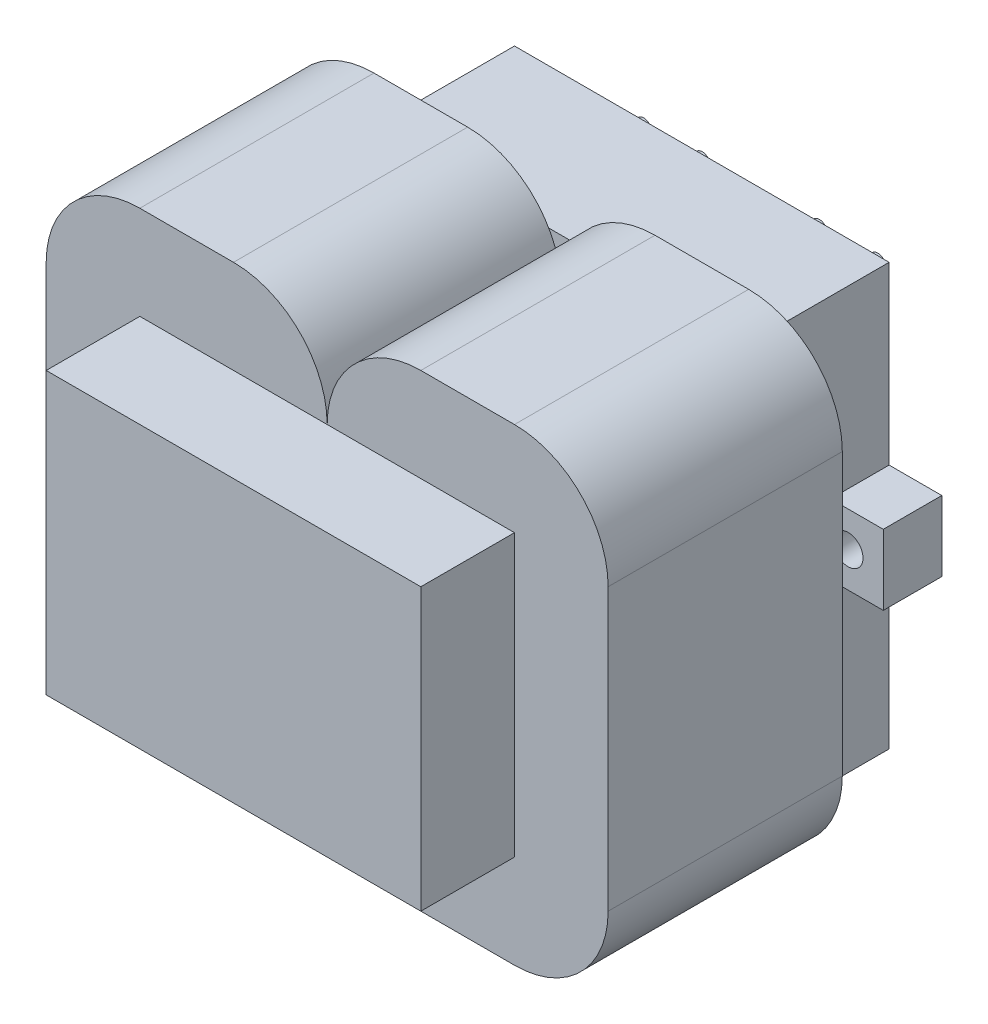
ISO-10303-21;
HEADER;
FILE_DESCRIPTION(('STEP AP214'),'2;1');
FILE_NAME('part.step','',(''),(''),'','','');
FILE_SCHEMA(('AUTOMOTIVE_DESIGN { 1 0 10303 214 1 1 1 1 }'));
ENDSEC;
DATA;
#1=APPLICATION_CONTEXT('core data for automotive mechanical design processes');
#2=APPLICATION_PROTOCOL_DEFINITION('international standard','automotive_design',2000,#1);
#3=PRODUCT_CONTEXT('',#1,'mechanical');
#4=PRODUCT('Part','Part','',(#3));
#5=PRODUCT_RELATED_PRODUCT_CATEGORY('part','',(#4));
#6=PRODUCT_DEFINITION_FORMATION('','',#4);
#7=PRODUCT_DEFINITION_CONTEXT('part definition',#1,'design');
#8=PRODUCT_DEFINITION('design','',#6,#7);
#9=PRODUCT_DEFINITION_SHAPE('','',#8);
#10=(LENGTH_UNIT() NAMED_UNIT(*) SI_UNIT(.MILLI.,.METRE.));
#11=(NAMED_UNIT(*) PLANE_ANGLE_UNIT() SI_UNIT($,.RADIAN.));
#12=(NAMED_UNIT(*) SI_UNIT($,.STERADIAN.) SOLID_ANGLE_UNIT());
#13=UNCERTAINTY_MEASURE_WITH_UNIT(LENGTH_MEASURE(1.E-05),#10,'distance_accuracy_value','');
#14=(GEOMETRIC_REPRESENTATION_CONTEXT(3) GLOBAL_UNCERTAINTY_ASSIGNED_CONTEXT((#13)) GLOBAL_UNIT_ASSIGNED_CONTEXT((#10,
#11,#12)) REPRESENTATION_CONTEXT('',''));
#15=CARTESIAN_POINT('',(0.,0.,0.));
#16=DIRECTION('',(0.,0.,1.));
#17=DIRECTION('',(1.,0.,0.));
#18=AXIS2_PLACEMENT_3D('',#15,#16,#17);
#19=CARTESIAN_POINT('',(-8.,-12.,32.));
#20=DIRECTION('',(0.,0.,-1.));
#21=DIRECTION('',(-1.,0.,0.));
#22=AXIS2_PLACEMENT_3D('',#19,#20,#21);
#23=CYLINDRICAL_SURFACE('',#22,8.);
#24=CARTESIAN_POINT('',(-8.,-12.,12.));
#25=DIRECTION('',(0.,0.,1.));
#26=DIRECTION('',(1.,0.,0.));
#27=AXIS2_PLACEMENT_3D('',#24,#25,#26);
#28=CIRCLE('',#27,8.);
#29=CARTESIAN_POINT('',(-8.,-20.,12.));
#30=VERTEX_POINT('',#29);
#31=CARTESIAN_POINT('',(0.,-12.,12.));
#32=VERTEX_POINT('',#31);
#33=EDGE_CURVE('E172',#30,#32,#28,.T.);
#34=ORIENTED_EDGE('',*,*,#33,.T.);
#35=DIRECTION('',(0.,0.,-1.));
#36=VECTOR('',#35,1.);
#37=CARTESIAN_POINT('',(0.,-12.,32.));
#38=LINE('',#37,#36);
#39=CARTESIAN_POINT('',(0.,-12.,32.));
#40=VERTEX_POINT('',#39);
#41=EDGE_CURVE('E12',#40,#32,#38,.T.);
#42=ORIENTED_EDGE('',*,*,#41,.F.);
#43=CARTESIAN_POINT('',(-8.,-12.,32.));
#44=DIRECTION('',(0.,0.,1.));
#45=DIRECTION('',(1.,0.,0.));
#46=AXIS2_PLACEMENT_3D('',#43,#44,#45);
#47=CIRCLE('',#46,8.);
#48=CARTESIAN_POINT('',(-8.,-20.,32.));
#49=VERTEX_POINT('',#48);
#50=EDGE_CURVE('E198',#49,#40,#47,.T.);
#51=ORIENTED_EDGE('',*,*,#50,.F.);
#52=DIRECTION('',(0.,0.,-1.));
#53=VECTOR('',#52,1.);
#54=CARTESIAN_POINT('',(-8.,-20.,32.));
#55=LINE('',#54,#53);
#56=EDGE_CURVE('E168',#49,#30,#55,.T.);
#57=ORIENTED_EDGE('',*,*,#56,.T.);
#58=EDGE_LOOP('',(#34,#42,#51,#57));
#59=FACE_BOUND('',#58,.T.);
#60=ADVANCED_FACE('F40',(#59),#23,.T.);
#61=CARTESIAN_POINT('',(8.,-12.,32.));
#62=DIRECTION('',(0.,0.,-1.));
#63=DIRECTION('',(-1.,0.,0.));
#64=AXIS2_PLACEMENT_3D('',#61,#62,#63);
#65=CYLINDRICAL_SURFACE('',#64,8.);
#66=CARTESIAN_POINT('',(8.,-12.,12.));
#67=DIRECTION('',(0.,0.,1.));
#68=DIRECTION('',(1.,0.,0.));
#69=AXIS2_PLACEMENT_3D('',#66,#67,#68);
#70=CIRCLE('',#69,8.);
#71=CARTESIAN_POINT('',(8.,-20.,12.));
#72=VERTEX_POINT('',#71);
#73=EDGE_CURVE('E175',#32,#72,#70,.T.);
#74=ORIENTED_EDGE('',*,*,#73,.T.);
#75=DIRECTION('',(0.,0.,-1.));
#76=VECTOR('',#75,1.);
#77=CARTESIAN_POINT('',(8.,-20.,32.));
#78=LINE('',#77,#76);
#79=CARTESIAN_POINT('',(8.,-20.,32.));
#80=VERTEX_POINT('',#79);
#81=EDGE_CURVE('E48',#80,#72,#78,.T.);
#82=ORIENTED_EDGE('',*,*,#81,.F.);
#83=CARTESIAN_POINT('',(8.,-12.,32.));
#84=DIRECTION('',(0.,0.,1.));
#85=DIRECTION('',(1.,0.,0.));
#86=AXIS2_PLACEMENT_3D('',#83,#84,#85);
#87=CIRCLE('',#86,8.);
#88=EDGE_CURVE('E117',#40,#80,#87,.T.);
#89=ORIENTED_EDGE('',*,*,#88,.F.);
#90=ORIENTED_EDGE('',*,*,#41,.T.);
#91=EDGE_LOOP('',(#74,#82,#89,#90));
#92=FACE_BOUND('',#91,.T.);
#93=ADVANCED_FACE('F286',(#92),#65,.T.);
#94=CARTESIAN_POINT('',(8.,-20.,32.));
#95=DIRECTION('',(0.,1.,0.));
#96=DIRECTION('',(0.,0.,1.));
#97=AXIS2_PLACEMENT_3D('',#94,#95,#96);
#98=PLANE('',#97);
#99=DIRECTION('',(1.,0.,0.));
#100=VECTOR('',#99,1.);
#101=CARTESIAN_POINT('',(8.,-20.,12.));
#102=LINE('',#101,#100);
#103=CARTESIAN_POINT('',(16.,-20.,12.));
#104=VERTEX_POINT('',#103);
#105=EDGE_CURVE('E177',#72,#104,#102,.T.);
#106=ORIENTED_EDGE('',*,*,#105,.T.);
#107=DIRECTION('',(0.,0.,-1.));
#108=VECTOR('',#107,1.);
#109=CARTESIAN_POINT('',(16.,-20.,32.));
#110=LINE('',#109,#108);
#111=CARTESIAN_POINT('',(16.,-20.,32.));
#112=VERTEX_POINT('',#111);
#113=EDGE_CURVE('E223',#112,#104,#110,.T.);
#114=ORIENTED_EDGE('',*,*,#113,.F.);
#115=DIRECTION('',(1.,0.,0.));
#116=VECTOR('',#115,1.);
#117=CARTESIAN_POINT('',(8.,-20.,32.));
#118=LINE('',#117,#116);
#119=EDGE_CURVE('E231',#80,#112,#118,.T.);
#120=ORIENTED_EDGE('',*,*,#119,.F.);
#121=ORIENTED_EDGE('',*,*,#81,.T.);
#122=EDGE_LOOP('',(#106,#114,#120,#121));
#123=FACE_BOUND('',#122,.T.);
#124=ADVANCED_FACE('F229',(#123),#98,.F.);
#125=CARTESIAN_POINT('',(16.,-12.,32.));
#126=DIRECTION('',(0.,0.,-1.));
#127=DIRECTION('',(-1.,0.,0.));
#128=AXIS2_PLACEMENT_3D('',#125,#126,#127);
#129=CYLINDRICAL_SURFACE('',#128,8.);
#130=CARTESIAN_POINT('',(16.,-12.,12.));
#131=DIRECTION('',(0.,0.,1.));
#132=DIRECTION('',(1.,0.,0.));
#133=AXIS2_PLACEMENT_3D('',#130,#131,#132);
#134=CIRCLE('',#133,8.);
#135=CARTESIAN_POINT('',(24.,-12.,12.));
#136=VERTEX_POINT('',#135);
#137=EDGE_CURVE('E179',#104,#136,#134,.T.);
#138=ORIENTED_EDGE('',*,*,#137,.T.);
#139=DIRECTION('',(0.,0.,-1.));
#140=VECTOR('',#139,1.);
#141=CARTESIAN_POINT('',(24.,-12.,32.));
#142=LINE('',#141,#140);
#143=CARTESIAN_POINT('',(24.,-12.,32.));
#144=VERTEX_POINT('',#143);
#145=EDGE_CURVE('E220',#144,#136,#142,.T.);
#146=ORIENTED_EDGE('',*,*,#145,.F.);
#147=CARTESIAN_POINT('',(16.,-12.,32.));
#148=DIRECTION('',(0.,0.,1.));
#149=DIRECTION('',(1.,0.,0.));
#150=AXIS2_PLACEMENT_3D('',#147,#148,#149);
#151=CIRCLE('',#150,8.);
#152=EDGE_CURVE('E249',#112,#144,#151,.T.);
#153=ORIENTED_EDGE('',*,*,#152,.F.);
#154=ORIENTED_EDGE('',*,*,#113,.T.);
#155=EDGE_LOOP('',(#138,#146,#153,#154));
#156=FACE_BOUND('',#155,.T.);
#157=ADVANCED_FACE('F240',(#156),#129,.T.);
#158=CARTESIAN_POINT('',(24.,12.,32.));
#159=DIRECTION('',(-1.,0.,0.));
#160=DIRECTION('',(0.,-1.,0.));
#161=AXIS2_PLACEMENT_3D('',#158,#159,#160);
#162=PLANE('',#161);
#163=DIRECTION('',(0.,1.,0.));
#164=VECTOR('',#163,1.);
#165=CARTESIAN_POINT('',(24.,12.,12.));
#166=LINE('',#165,#164);
#167=CARTESIAN_POINT('',(24.,12.,12.));
#168=VERTEX_POINT('',#167);
#169=EDGE_CURVE('E181',#136,#168,#166,.T.);
#170=ORIENTED_EDGE('',*,*,#169,.T.);
#171=DIRECTION('',(0.,0.,-1.));
#172=VECTOR('',#171,1.);
#173=CARTESIAN_POINT('',(24.,12.,32.));
#174=LINE('',#173,#172);
#175=CARTESIAN_POINT('',(24.,12.,32.));
#176=VERTEX_POINT('',#175);
#177=EDGE_CURVE('E217',#176,#168,#174,.T.);
#178=ORIENTED_EDGE('',*,*,#177,.F.);
#179=DIRECTION('',(0.,1.,0.));
#180=VECTOR('',#179,1.);
#181=CARTESIAN_POINT('',(24.,12.,32.));
#182=LINE('',#181,#180);
#183=EDGE_CURVE('E246',#144,#176,#182,.T.);
#184=ORIENTED_EDGE('',*,*,#183,.F.);
#185=ORIENTED_EDGE('',*,*,#145,.T.);
#186=EDGE_LOOP('',(#170,#178,#184,#185));
#187=FACE_BOUND('',#186,.T.);
#188=ADVANCED_FACE('F244',(#187),#162,.F.);
#189=CARTESIAN_POINT('',(16.,12.,32.));
#190=DIRECTION('',(0.,0.,-1.));
#191=DIRECTION('',(-1.,0.,0.));
#192=AXIS2_PLACEMENT_3D('',#189,#190,#191);
#193=CYLINDRICAL_SURFACE('',#192,8.);
#194=CARTESIAN_POINT('',(16.,12.,12.));
#195=DIRECTION('',(0.,0.,1.));
#196=DIRECTION('',(1.,0.,0.));
#197=AXIS2_PLACEMENT_3D('',#194,#195,#196);
#198=CIRCLE('',#197,8.);
#199=CARTESIAN_POINT('',(16.,20.,12.));
#200=VERTEX_POINT('',#199);
#201=EDGE_CURVE('E183',#168,#200,#198,.T.);
#202=ORIENTED_EDGE('',*,*,#201,.T.);
#203=DIRECTION('',(0.,0.,-1.));
#204=VECTOR('',#203,1.);
#205=CARTESIAN_POINT('',(16.,20.,32.));
#206=LINE('',#205,#204);
#207=CARTESIAN_POINT('',(16.,20.,32.));
#208=VERTEX_POINT('',#207);
#209=EDGE_CURVE('E214',#208,#200,#206,.T.);
#210=ORIENTED_EDGE('',*,*,#209,.F.);
#211=CARTESIAN_POINT('',(16.,12.,32.));
#212=DIRECTION('',(0.,0.,1.));
#213=DIRECTION('',(1.,0.,0.));
#214=AXIS2_PLACEMENT_3D('',#211,#212,#213);
#215=CIRCLE('',#214,8.);
#216=EDGE_CURVE('E248',#176,#208,#215,.T.);
#217=ORIENTED_EDGE('',*,*,#216,.F.);
#218=ORIENTED_EDGE('',*,*,#177,.T.);
#219=EDGE_LOOP('',(#202,#210,#217,#218));
#220=FACE_BOUND('',#219,.T.);
#221=ADVANCED_FACE('F299',(#220),#193,.T.);
#222=CARTESIAN_POINT('',(8.,20.,32.));
#223=DIRECTION('',(0.,-1.,0.));
#224=DIRECTION('',(0.,0.,-1.));
#225=AXIS2_PLACEMENT_3D('',#222,#223,#224);
#226=PLANE('',#225);
#227=DIRECTION('',(-1.,0.,0.));
#228=VECTOR('',#227,1.);
#229=CARTESIAN_POINT('',(8.,20.,12.));
#230=LINE('',#229,#228);
#231=CARTESIAN_POINT('',(8.,20.,12.));
#232=VERTEX_POINT('',#231);
#233=EDGE_CURVE('E185',#200,#232,#230,.T.);
#234=ORIENTED_EDGE('',*,*,#233,.T.);
#235=DIRECTION('',(0.,0.,-1.));
#236=VECTOR('',#235,1.);
#237=CARTESIAN_POINT('',(8.,20.,32.));
#238=LINE('',#237,#236);
#239=CARTESIAN_POINT('',(8.,20.,32.));
#240=VERTEX_POINT('',#239);
#241=EDGE_CURVE('E211',#240,#232,#238,.T.);
#242=ORIENTED_EDGE('',*,*,#241,.F.);
#243=DIRECTION('',(-1.,0.,0.));
#244=VECTOR('',#243,1.);
#245=CARTESIAN_POINT('',(8.,20.,32.));
#246=LINE('',#245,#244);
#247=EDGE_CURVE('E251',#208,#240,#246,.T.);
#248=ORIENTED_EDGE('',*,*,#247,.F.);
#249=ORIENTED_EDGE('',*,*,#209,.T.);
#250=EDGE_LOOP('',(#234,#242,#248,#249));
#251=FACE_BOUND('',#250,.T.);
#252=ADVANCED_FACE('F302',(#251),#226,.F.);
#253=CARTESIAN_POINT('',(8.,12.,32.));
#254=DIRECTION('',(0.,0.,-1.));
#255=DIRECTION('',(-1.,0.,0.));
#256=AXIS2_PLACEMENT_3D('',#253,#254,#255);
#257=CYLINDRICAL_SURFACE('',#256,8.);
#258=CARTESIAN_POINT('',(8.,12.,12.));
#259=DIRECTION('',(0.,0.,1.));
#260=DIRECTION('',(-1.,0.,0.));
#261=AXIS2_PLACEMENT_3D('',#258,#259,#260);
#262=CIRCLE('',#261,8.);
#263=CARTESIAN_POINT('',(0.,12.,12.));
#264=VERTEX_POINT('',#263);
#265=EDGE_CURVE('E187',#232,#264,#262,.T.);
#266=ORIENTED_EDGE('',*,*,#265,.T.);
#267=DIRECTION('',(0.,0.,-1.));
#268=VECTOR('',#267,1.);
#269=CARTESIAN_POINT('',(0.,12.,32.));
#270=LINE('',#269,#268);
#271=CARTESIAN_POINT('',(0.,12.,32.));
#272=VERTEX_POINT('',#271);
#273=EDGE_CURVE('E208',#272,#264,#270,.T.);
#274=ORIENTED_EDGE('',*,*,#273,.F.);
#275=CARTESIAN_POINT('',(8.,12.,32.));
#276=DIRECTION('',(0.,0.,1.));
#277=DIRECTION('',(-1.,0.,0.));
#278=AXIS2_PLACEMENT_3D('',#275,#276,#277);
#279=CIRCLE('',#278,8.);
#280=EDGE_CURVE('E257',#240,#272,#279,.T.);
#281=ORIENTED_EDGE('',*,*,#280,.F.);
#282=ORIENTED_EDGE('',*,*,#241,.T.);
#283=EDGE_LOOP('',(#266,#274,#281,#282));
#284=FACE_BOUND('',#283,.T.);
#285=ADVANCED_FACE('F306',(#284),#257,.T.);
#286=CARTESIAN_POINT('',(-8.,12.,32.));
#287=DIRECTION('',(0.,0.,-1.));
#288=DIRECTION('',(-1.,0.,0.));
#289=AXIS2_PLACEMENT_3D('',#286,#287,#288);
#290=CYLINDRICAL_SURFACE('',#289,8.);
#291=CARTESIAN_POINT('',(-8.,12.,12.));
#292=DIRECTION('',(0.,0.,1.));
#293=DIRECTION('',(-1.,0.,0.));
#294=AXIS2_PLACEMENT_3D('',#291,#292,#293);
#295=CIRCLE('',#294,8.);
#296=CARTESIAN_POINT('',(-8.,20.,12.));
#297=VERTEX_POINT('',#296);
#298=EDGE_CURVE('E189',#264,#297,#295,.T.);
#299=ORIENTED_EDGE('',*,*,#298,.T.);
#300=DIRECTION('',(0.,0.,-1.));
#301=VECTOR('',#300,1.);
#302=CARTESIAN_POINT('',(-8.,20.,32.));
#303=LINE('',#302,#301);
#304=CARTESIAN_POINT('',(-8.,20.,32.));
#305=VERTEX_POINT('',#304);
#306=EDGE_CURVE('E205',#305,#297,#303,.T.);
#307=ORIENTED_EDGE('',*,*,#306,.F.);
#308=CARTESIAN_POINT('',(-8.,12.,32.));
#309=DIRECTION('',(0.,0.,1.));
#310=DIRECTION('',(-1.,0.,0.));
#311=AXIS2_PLACEMENT_3D('',#308,#309,#310);
#312=CIRCLE('',#311,8.);
#313=EDGE_CURVE('E259',#272,#305,#312,.T.);
#314=ORIENTED_EDGE('',*,*,#313,.F.);
#315=ORIENTED_EDGE('',*,*,#273,.T.);
#316=EDGE_LOOP('',(#299,#307,#314,#315));
#317=FACE_BOUND('',#316,.T.);
#318=ADVANCED_FACE('F310',(#317),#290,.T.);
#319=CARTESIAN_POINT('',(-8.,20.,32.));
#320=DIRECTION('',(0.,-1.,0.));
#321=DIRECTION('',(0.,0.,-1.));
#322=AXIS2_PLACEMENT_3D('',#319,#320,#321);
#323=PLANE('',#322);
#324=DIRECTION('',(-1.,0.,0.));
#325=VECTOR('',#324,1.);
#326=CARTESIAN_POINT('',(-8.,20.,12.));
#327=LINE('',#326,#325);
#328=CARTESIAN_POINT('',(-16.,20.,12.));
#329=VERTEX_POINT('',#328);
#330=EDGE_CURVE('E191',#297,#329,#327,.T.);
#331=ORIENTED_EDGE('',*,*,#330,.T.);
#332=DIRECTION('',(0.,0.,-1.));
#333=VECTOR('',#332,1.);
#334=CARTESIAN_POINT('',(-16.,20.,32.));
#335=LINE('',#334,#333);
#336=CARTESIAN_POINT('',(-16.,20.,32.));
#337=VERTEX_POINT('',#336);
#338=EDGE_CURVE('E202',#337,#329,#335,.T.);
#339=ORIENTED_EDGE('',*,*,#338,.F.);
#340=DIRECTION('',(-1.,0.,0.));
#341=VECTOR('',#340,1.);
#342=CARTESIAN_POINT('',(-8.,20.,32.));
#343=LINE('',#342,#341);
#344=EDGE_CURVE('E261',#305,#337,#343,.T.);
#345=ORIENTED_EDGE('',*,*,#344,.F.);
#346=ORIENTED_EDGE('',*,*,#306,.T.);
#347=EDGE_LOOP('',(#331,#339,#345,#346));
#348=FACE_BOUND('',#347,.T.);
#349=ADVANCED_FACE('F267',(#348),#323,.F.);
#350=CARTESIAN_POINT('',(-16.,12.,32.));
#351=DIRECTION('',(0.,0.,-1.));
#352=DIRECTION('',(-1.,0.,0.));
#353=AXIS2_PLACEMENT_3D('',#350,#351,#352);
#354=CYLINDRICAL_SURFACE('',#353,8.);
#355=CARTESIAN_POINT('',(-16.,12.,12.));
#356=DIRECTION('',(0.,0.,1.));
#357=DIRECTION('',(-1.,0.,0.));
#358=AXIS2_PLACEMENT_3D('',#355,#356,#357);
#359=CIRCLE('',#358,8.);
#360=CARTESIAN_POINT('',(-24.,12.,12.));
#361=VERTEX_POINT('',#360);
#362=EDGE_CURVE('E193',#329,#361,#359,.T.);
#363=ORIENTED_EDGE('',*,*,#362,.T.);
#364=DIRECTION('',(0.,0.,-1.));
#365=VECTOR('',#364,1.);
#366=CARTESIAN_POINT('',(-24.,12.,32.));
#367=LINE('',#366,#365);
#368=CARTESIAN_POINT('',(-24.,12.,32.));
#369=VERTEX_POINT('',#368);
#370=EDGE_CURVE('E163',#369,#361,#367,.T.);
#371=ORIENTED_EDGE('',*,*,#370,.F.);
#372=CARTESIAN_POINT('',(-16.,12.,32.));
#373=DIRECTION('',(0.,0.,1.));
#374=DIRECTION('',(-1.,0.,0.));
#375=AXIS2_PLACEMENT_3D('',#372,#373,#374);
#376=CIRCLE('',#375,8.);
#377=EDGE_CURVE('E154',#337,#369,#376,.T.);
#378=ORIENTED_EDGE('',*,*,#377,.F.);
#379=ORIENTED_EDGE('',*,*,#338,.T.);
#380=EDGE_LOOP('',(#363,#371,#378,#379));
#381=FACE_BOUND('',#380,.T.);
#382=ADVANCED_FACE('F271',(#381),#354,.T.);
#383=CARTESIAN_POINT('',(-24.,-12.,32.));
#384=DIRECTION('',(1.,0.,0.));
#385=DIRECTION('',(0.,0.,-1.));
#386=AXIS2_PLACEMENT_3D('',#383,#384,#385);
#387=PLANE('',#386);
#388=DIRECTION('',(0.,-1.,0.));
#389=VECTOR('',#388,1.);
#390=CARTESIAN_POINT('',(-24.,-12.,12.));
#391=LINE('',#390,#389);
#392=CARTESIAN_POINT('',(-24.,-12.,12.));
#393=VERTEX_POINT('',#392);
#394=EDGE_CURVE('E162',#361,#393,#391,.T.);
#395=ORIENTED_EDGE('',*,*,#394,.T.);
#396=DIRECTION('',(0.,0.,-1.));
#397=VECTOR('',#396,1.);
#398=CARTESIAN_POINT('',(-24.,-12.,32.));
#399=LINE('',#398,#397);
#400=CARTESIAN_POINT('',(-24.,-12.,32.));
#401=VERTEX_POINT('',#400);
#402=EDGE_CURVE('E159',#401,#393,#399,.T.);
#403=ORIENTED_EDGE('',*,*,#402,.F.);
#404=DIRECTION('',(0.,-1.,0.));
#405=VECTOR('',#404,1.);
#406=CARTESIAN_POINT('',(-24.,-12.,32.));
#407=LINE('',#406,#405);
#408=EDGE_CURVE('E148',#369,#401,#407,.T.);
#409=ORIENTED_EDGE('',*,*,#408,.F.);
#410=ORIENTED_EDGE('',*,*,#370,.T.);
#411=EDGE_LOOP('',(#395,#403,#409,#410));
#412=FACE_BOUND('',#411,.T.);
#413=ADVANCED_FACE('F160',(#412),#387,.F.);
#414=CARTESIAN_POINT('',(-16.,-12.,32.));
#415=DIRECTION('',(0.,0.,-1.));
#416=DIRECTION('',(-1.,0.,0.));
#417=AXIS2_PLACEMENT_3D('',#414,#415,#416);
#418=CYLINDRICAL_SURFACE('',#417,8.);
#419=CARTESIAN_POINT('',(-16.,-12.,12.));
#420=DIRECTION('',(0.,0.,1.));
#421=DIRECTION('',(1.,0.,0.));
#422=AXIS2_PLACEMENT_3D('',#419,#420,#421);
#423=CIRCLE('',#422,8.);
#424=CARTESIAN_POINT('',(-16.,-20.,12.));
#425=VERTEX_POINT('',#424);
#426=EDGE_CURVE('E103',#393,#425,#423,.T.);
#427=ORIENTED_EDGE('',*,*,#426,.T.);
#428=DIRECTION('',(0.,0.,-1.));
#429=VECTOR('',#428,1.);
#430=CARTESIAN_POINT('',(-16.,-20.,32.));
#431=LINE('',#430,#429);
#432=CARTESIAN_POINT('',(-16.,-20.,32.));
#433=VERTEX_POINT('',#432);
#434=EDGE_CURVE('E164',#433,#425,#431,.T.);
#435=ORIENTED_EDGE('',*,*,#434,.F.);
#436=CARTESIAN_POINT('',(-16.,-12.,32.));
#437=DIRECTION('',(0.,0.,1.));
#438=DIRECTION('',(1.,0.,0.));
#439=AXIS2_PLACEMENT_3D('',#436,#437,#438);
#440=CIRCLE('',#439,8.);
#441=EDGE_CURVE('E152',#401,#433,#440,.T.);
#442=ORIENTED_EDGE('',*,*,#441,.F.);
#443=ORIENTED_EDGE('',*,*,#402,.T.);
#444=EDGE_LOOP('',(#427,#435,#442,#443));
#445=FACE_BOUND('',#444,.T.);
#446=ADVANCED_FACE('F166',(#445),#418,.T.);
#447=CARTESIAN_POINT('',(-16.,-20.,32.));
#448=DIRECTION('',(0.,1.,0.));
#449=DIRECTION('',(0.,0.,1.));
#450=AXIS2_PLACEMENT_3D('',#447,#448,#449);
#451=PLANE('',#450);
#452=DIRECTION('',(1.,0.,0.));
#453=VECTOR('',#452,1.);
#454=CARTESIAN_POINT('',(-16.,-20.,12.));
#455=LINE('',#454,#453);
#456=EDGE_CURVE('E109',#425,#30,#455,.T.);
#457=ORIENTED_EDGE('',*,*,#456,.T.);
#458=ORIENTED_EDGE('',*,*,#56,.F.);
#459=DIRECTION('',(1.,0.,0.));
#460=VECTOR('',#459,1.);
#461=CARTESIAN_POINT('',(-16.,-20.,32.));
#462=LINE('',#461,#460);
#463=EDGE_CURVE('E56',#433,#49,#462,.T.);
#464=ORIENTED_EDGE('',*,*,#463,.F.);
#465=ORIENTED_EDGE('',*,*,#434,.T.);
#466=EDGE_LOOP('',(#457,#458,#464,#465));
#467=FACE_BOUND('',#466,.T.);
#468=ADVANCED_FACE('F275',(#467),#451,.F.);
#469=CARTESIAN_POINT('',(-8.,-12.,32.));
#470=DIRECTION('',(0.,0.,1.));
#471=DIRECTION('',(1.,0.,0.));
#472=AXIS2_PLACEMENT_3D('',#469,#470,#471);
#473=PLANE('',#472);
#474=ORIENTED_EDGE('',*,*,#50,.T.);
#475=ORIENTED_EDGE('',*,*,#88,.T.);
#476=ORIENTED_EDGE('',*,*,#119,.T.);
#477=ORIENTED_EDGE('',*,*,#152,.T.);
#478=ORIENTED_EDGE('',*,*,#183,.T.);
#479=ORIENTED_EDGE('',*,*,#216,.T.);
#480=ORIENTED_EDGE('',*,*,#247,.T.);
#481=ORIENTED_EDGE('',*,*,#280,.T.);
#482=ORIENTED_EDGE('',*,*,#313,.T.);
#483=ORIENTED_EDGE('',*,*,#344,.T.);
#484=ORIENTED_EDGE('',*,*,#377,.T.);
#485=ORIENTED_EDGE('',*,*,#408,.T.);
#486=ORIENTED_EDGE('',*,*,#441,.T.);
#487=ORIENTED_EDGE('',*,*,#463,.T.);
#488=EDGE_LOOP('',(#474,#475,#476,#477,#478,#479,#480,#481,#482,#483,#484,#485,#486,#487));
#489=FACE_BOUND('',#488,.T.);
#490=ADVANCED_FACE('F150',(#489),#473,.T.);
#491=CARTESIAN_POINT('',(-8.,-12.,12.));
#492=DIRECTION('',(0.,0.,1.));
#493=DIRECTION('',(1.,0.,0.));
#494=AXIS2_PLACEMENT_3D('',#491,#492,#493);
#495=PLANE('',#494);
#496=ORIENTED_EDGE('',*,*,#33,.F.);
#497=ORIENTED_EDGE('',*,*,#456,.F.);
#498=ORIENTED_EDGE('',*,*,#426,.F.);
#499=ORIENTED_EDGE('',*,*,#394,.F.);
#500=ORIENTED_EDGE('',*,*,#362,.F.);
#501=ORIENTED_EDGE('',*,*,#330,.F.);
#502=ORIENTED_EDGE('',*,*,#298,.F.);
#503=ORIENTED_EDGE('',*,*,#265,.F.);
#504=ORIENTED_EDGE('',*,*,#233,.F.);
#505=ORIENTED_EDGE('',*,*,#201,.F.);
#506=ORIENTED_EDGE('',*,*,#169,.F.);
#507=ORIENTED_EDGE('',*,*,#137,.F.);
#508=ORIENTED_EDGE('',*,*,#105,.F.);
#509=ORIENTED_EDGE('',*,*,#73,.F.);
#510=EDGE_LOOP('',(#496,#497,#498,#499,#500,#501,#502,#503,#504,#505,#506,#507,#508,#509));
#511=FACE_BOUND('',#510,.T.);
#512=ADVANCED_FACE('F235',(#511),#495,.F.);
#513=CLOSED_SHELL('',(#60,#93,#124,#157,#188,#221,#252,#285,#318,#349,#382,#413,#446,#468,#490,#512));
#514=MANIFOLD_SOLID_BREP('B2',#513);
#515=CARTESIAN_POINT('',(-7.50062,12.99972,-2.54));
#516=DIRECTION('',(0.,0.,1.));
#517=DIRECTION('',(1.,0.,0.));
#518=AXIS2_PLACEMENT_3D('',#515,#516,#517);
#519=CYLINDRICAL_SURFACE('',#518,0.660399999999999);
#520=CARTESIAN_POINT('',(-7.50062,12.99972,-2.54));
#521=DIRECTION('',(0.,0.,-1.));
#522=DIRECTION('',(-1.,0.,0.));
#523=AXIS2_PLACEMENT_3D('',#520,#521,#522);
#524=CIRCLE('',#523,0.660399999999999);
#525=CARTESIAN_POINT('',(-8.16102,12.99972,-2.54));
#526=VERTEX_POINT('',#525);
#527=EDGE_CURVE('E39',#526,#526,#524,.T.);
#528=ORIENTED_EDGE('',*,*,#527,.F.);
#529=EDGE_LOOP('',(#528));
#530=FACE_BOUND('',#529,.T.);
#531=CARTESIAN_POINT('',(-7.50062,12.99972,0.));
#532=DIRECTION('',(0.,0.,-1.));
#533=DIRECTION('',(-1.,0.,0.));
#534=AXIS2_PLACEMENT_3D('',#531,#532,#533);
#535=CIRCLE('',#534,0.660399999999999);
#536=CARTESIAN_POINT('',(-8.16102,12.99972,0.));
#537=VERTEX_POINT('',#536);
#538=EDGE_CURVE('E435',#537,#537,#535,.T.);
#539=ORIENTED_EDGE('',*,*,#538,.T.);
#540=EDGE_LOOP('',(#539));
#541=FACE_BOUND('',#540,.T.);
#542=ADVANCED_FACE('F432',(#530,#541),#519,.T.);
#543=CARTESIAN_POINT('',(-7.50062,12.99972,-2.54));
#544=DIRECTION('',(0.,0.,-1.));
#545=DIRECTION('',(-1.,0.,0.));
#546=AXIS2_PLACEMENT_3D('',#543,#544,#545);
#547=PLANE('',#546);
#548=ORIENTED_EDGE('',*,*,#527,.T.);
#549=EDGE_LOOP('',(#548));
#550=FACE_BOUND('',#549,.T.);
#551=ADVANCED_FACE('F447',(#550),#547,.T.);
#552=CARTESIAN_POINT('',(-7.50062,12.99972,0.));
#553=DIRECTION('',(0.,0.,-1.));
#554=DIRECTION('',(-1.,0.,0.));
#555=AXIS2_PLACEMENT_3D('',#552,#553,#554);
#556=PLANE('',#555);
#557=ORIENTED_EDGE('',*,*,#538,.F.);
#558=EDGE_LOOP('',(#557));
#559=FACE_BOUND('',#558,.T.);
#560=ADVANCED_FACE('F445',(#559),#556,.F.);
#561=CLOSED_SHELL('',(#542,#551,#560));
#562=MANIFOLD_SOLID_BREP('B6',#561);
#563=CARTESIAN_POINT('',(-2.49936,12.99972,-2.54));
#564=DIRECTION('',(0.,0.,1.));
#565=DIRECTION('',(1.,0.,0.));
#566=AXIS2_PLACEMENT_3D('',#563,#564,#565);
#567=CYLINDRICAL_SURFACE('',#566,0.6604);
#568=CARTESIAN_POINT('',(-2.49936,12.99972,-2.54));
#569=DIRECTION('',(0.,0.,-1.));
#570=DIRECTION('',(-1.,0.,0.));
#571=AXIS2_PLACEMENT_3D('',#568,#569,#570);
#572=CIRCLE('',#571,0.6604);
#573=CARTESIAN_POINT('',(-3.15976,12.99972,-2.54));
#574=VERTEX_POINT('',#573);
#575=EDGE_CURVE('E431',#574,#574,#572,.T.);
#576=ORIENTED_EDGE('',*,*,#575,.F.);
#577=EDGE_LOOP('',(#576));
#578=FACE_BOUND('',#577,.T.);
#579=CARTESIAN_POINT('',(-2.49936,12.99972,0.));
#580=DIRECTION('',(0.,0.,-1.));
#581=DIRECTION('',(-1.,0.,0.));
#582=AXIS2_PLACEMENT_3D('',#579,#580,#581);
#583=CIRCLE('',#582,0.6604);
#584=CARTESIAN_POINT('',(-3.15976,12.99972,0.));
#585=VERTEX_POINT('',#584);
#586=EDGE_CURVE('E484',#585,#585,#583,.T.);
#587=ORIENTED_EDGE('',*,*,#586,.T.);
#588=EDGE_LOOP('',(#587));
#589=FACE_BOUND('',#588,.T.);
#590=ADVANCED_FACE('F481',(#578,#589),#567,.T.);
#591=CARTESIAN_POINT('',(-2.49936,12.99972,-2.54));
#592=DIRECTION('',(0.,0.,-1.));
#593=DIRECTION('',(-1.,0.,0.));
#594=AXIS2_PLACEMENT_3D('',#591,#592,#593);
#595=PLANE('',#594);
#596=ORIENTED_EDGE('',*,*,#575,.T.);
#597=EDGE_LOOP('',(#596));
#598=FACE_BOUND('',#597,.T.);
#599=ADVANCED_FACE('F496',(#598),#595,.T.);
#600=CARTESIAN_POINT('',(-2.49936,12.99972,0.));
#601=DIRECTION('',(0.,0.,-1.));
#602=DIRECTION('',(-1.,0.,0.));
#603=AXIS2_PLACEMENT_3D('',#600,#601,#602);
#604=PLANE('',#603);
#605=ORIENTED_EDGE('',*,*,#586,.F.);
#606=EDGE_LOOP('',(#605));
#607=FACE_BOUND('',#606,.T.);
#608=ADVANCED_FACE('F494',(#607),#604,.F.);
#609=CLOSED_SHELL('',(#590,#599,#608));
#610=MANIFOLD_SOLID_BREP('B34',#609);
#611=CARTESIAN_POINT('',(7.50062,12.99972,-2.54));
#612=DIRECTION('',(0.,0.,1.));
#613=DIRECTION('',(1.,0.,0.));
#614=AXIS2_PLACEMENT_3D('',#611,#612,#613);
#615=CYLINDRICAL_SURFACE('',#614,0.6604);
#616=CARTESIAN_POINT('',(7.50062,12.99972,-2.54));
#617=DIRECTION('',(0.,0.,-1.));
#618=DIRECTION('',(-1.,0.,0.));
#619=AXIS2_PLACEMENT_3D('',#616,#617,#618);
#620=CIRCLE('',#619,0.6604);
#621=CARTESIAN_POINT('',(6.84022,12.99972,-2.54));
#622=VERTEX_POINT('',#621);
#623=EDGE_CURVE('E480',#622,#622,#620,.T.);
#624=ORIENTED_EDGE('',*,*,#623,.F.);
#625=EDGE_LOOP('',(#624));
#626=FACE_BOUND('',#625,.T.);
#627=CARTESIAN_POINT('',(7.50062,12.99972,0.));
#628=DIRECTION('',(0.,0.,-1.));
#629=DIRECTION('',(-1.,0.,0.));
#630=AXIS2_PLACEMENT_3D('',#627,#628,#629);
#631=CIRCLE('',#630,0.6604);
#632=CARTESIAN_POINT('',(6.84022,12.99972,0.));
#633=VERTEX_POINT('',#632);
#634=EDGE_CURVE('E533',#633,#633,#631,.T.);
#635=ORIENTED_EDGE('',*,*,#634,.T.);
#636=EDGE_LOOP('',(#635));
#637=FACE_BOUND('',#636,.T.);
#638=ADVANCED_FACE('F530',(#626,#637),#615,.T.);
#639=CARTESIAN_POINT('',(7.50062,12.99972,-2.54));
#640=DIRECTION('',(0.,0.,-1.));
#641=DIRECTION('',(-1.,0.,0.));
#642=AXIS2_PLACEMENT_3D('',#639,#640,#641);
#643=PLANE('',#642);
#644=ORIENTED_EDGE('',*,*,#623,.T.);
#645=EDGE_LOOP('',(#644));
#646=FACE_BOUND('',#645,.T.);
#647=ADVANCED_FACE('F545',(#646),#643,.T.);
#648=CARTESIAN_POINT('',(7.50062,12.99972,0.));
#649=DIRECTION('',(0.,0.,-1.));
#650=DIRECTION('',(-1.,0.,0.));
#651=AXIS2_PLACEMENT_3D('',#648,#649,#650);
#652=PLANE('',#651);
#653=ORIENTED_EDGE('',*,*,#634,.F.);
#654=EDGE_LOOP('',(#653));
#655=FACE_BOUND('',#654,.T.);
#656=ADVANCED_FACE('F543',(#655),#652,.F.);
#657=CLOSED_SHELL('',(#638,#647,#656));
#658=MANIFOLD_SOLID_BREP('B426',#657);
#659=CARTESIAN_POINT('',(12.49934,12.99972,-2.54));
#660=DIRECTION('',(0.,0.,1.));
#661=DIRECTION('',(1.,0.,0.));
#662=AXIS2_PLACEMENT_3D('',#659,#660,#661);
#663=CYLINDRICAL_SURFACE('',#662,0.6604);
#664=CARTESIAN_POINT('',(12.49934,12.99972,-2.54));
#665=DIRECTION('',(0.,0.,-1.));
#666=DIRECTION('',(-1.,0.,0.));
#667=AXIS2_PLACEMENT_3D('',#664,#665,#666);
#668=CIRCLE('',#667,0.6604);
#669=CARTESIAN_POINT('',(11.83894,12.99972,-2.54));
#670=VERTEX_POINT('',#669);
#671=EDGE_CURVE('E529',#670,#670,#668,.T.);
#672=ORIENTED_EDGE('',*,*,#671,.F.);
#673=EDGE_LOOP('',(#672));
#674=FACE_BOUND('',#673,.T.);
#675=CARTESIAN_POINT('',(12.49934,12.99972,0.));
#676=DIRECTION('',(0.,0.,-1.));
#677=DIRECTION('',(-1.,0.,0.));
#678=AXIS2_PLACEMENT_3D('',#675,#676,#677);
#679=CIRCLE('',#678,0.6604);
#680=CARTESIAN_POINT('',(11.83894,12.99972,0.));
#681=VERTEX_POINT('',#680);
#682=EDGE_CURVE('E582',#681,#681,#679,.T.);
#683=ORIENTED_EDGE('',*,*,#682,.T.);
#684=EDGE_LOOP('',(#683));
#685=FACE_BOUND('',#684,.T.);
#686=ADVANCED_FACE('F579',(#674,#685),#663,.T.);
#687=CARTESIAN_POINT('',(12.49934,12.99972,-2.54));
#688=DIRECTION('',(0.,0.,-1.));
#689=DIRECTION('',(-1.,0.,0.));
#690=AXIS2_PLACEMENT_3D('',#687,#688,#689);
#691=PLANE('',#690);
#692=ORIENTED_EDGE('',*,*,#671,.T.);
#693=EDGE_LOOP('',(#692));
#694=FACE_BOUND('',#693,.T.);
#695=ADVANCED_FACE('F594',(#694),#691,.T.);
#696=CARTESIAN_POINT('',(12.49934,12.99972,0.));
#697=DIRECTION('',(0.,0.,-1.));
#698=DIRECTION('',(-1.,0.,0.));
#699=AXIS2_PLACEMENT_3D('',#696,#697,#698);
#700=PLANE('',#699);
#701=ORIENTED_EDGE('',*,*,#682,.F.);
#702=EDGE_LOOP('',(#701));
#703=FACE_BOUND('',#702,.T.);
#704=ADVANCED_FACE('F592',(#703),#700,.F.);
#705=CLOSED_SHELL('',(#686,#695,#704));
#706=MANIFOLD_SOLID_BREP('B475',#705);
#707=CARTESIAN_POINT('',(-9.99998,-12.99972,-2.54));
#708=DIRECTION('',(0.,0.,1.));
#709=DIRECTION('',(1.,0.,0.));
#710=AXIS2_PLACEMENT_3D('',#707,#708,#709);
#711=CYLINDRICAL_SURFACE('',#710,0.6604);
#712=CARTESIAN_POINT('',(-9.99998,-12.99972,-2.54));
#713=DIRECTION('',(0.,0.,-1.));
#714=DIRECTION('',(-1.,0.,0.));
#715=AXIS2_PLACEMENT_3D('',#712,#713,#714);
#716=CIRCLE('',#715,0.6604);
#717=CARTESIAN_POINT('',(-10.66038,-12.99972,-2.54));
#718=VERTEX_POINT('',#717);
#719=EDGE_CURVE('E578',#718,#718,#716,.T.);
#720=ORIENTED_EDGE('',*,*,#719,.F.);
#721=EDGE_LOOP('',(#720));
#722=FACE_BOUND('',#721,.T.);
#723=CARTESIAN_POINT('',(-9.99998,-12.99972,0.));
#724=DIRECTION('',(0.,0.,-1.));
#725=DIRECTION('',(-1.,0.,0.));
#726=AXIS2_PLACEMENT_3D('',#723,#724,#725);
#727=CIRCLE('',#726,0.6604);
#728=CARTESIAN_POINT('',(-10.66038,-12.99972,0.));
#729=VERTEX_POINT('',#728);
#730=EDGE_CURVE('E631',#729,#729,#727,.T.);
#731=ORIENTED_EDGE('',*,*,#730,.T.);
#732=EDGE_LOOP('',(#731));
#733=FACE_BOUND('',#732,.T.);
#734=ADVANCED_FACE('F628',(#722,#733),#711,.T.);
#735=CARTESIAN_POINT('',(-9.99998,-12.99972,-2.54));
#736=DIRECTION('',(0.,0.,-1.));
#737=DIRECTION('',(-1.,0.,0.));
#738=AXIS2_PLACEMENT_3D('',#735,#736,#737);
#739=PLANE('',#738);
#740=ORIENTED_EDGE('',*,*,#719,.T.);
#741=EDGE_LOOP('',(#740));
#742=FACE_BOUND('',#741,.T.);
#743=ADVANCED_FACE('F643',(#742),#739,.T.);
#744=CARTESIAN_POINT('',(-9.99998,-12.99972,0.));
#745=DIRECTION('',(0.,0.,-1.));
#746=DIRECTION('',(-1.,0.,0.));
#747=AXIS2_PLACEMENT_3D('',#744,#745,#746);
#748=PLANE('',#747);
#749=ORIENTED_EDGE('',*,*,#730,.F.);
#750=EDGE_LOOP('',(#749));
#751=FACE_BOUND('',#750,.T.);
#752=ADVANCED_FACE('F641',(#751),#748,.F.);
#753=CLOSED_SHELL('',(#734,#743,#752));
#754=MANIFOLD_SOLID_BREP('B524',#753);
#755=CARTESIAN_POINT('',(9.99998,-12.99972,-2.54));
#756=DIRECTION('',(0.,0.,1.));
#757=DIRECTION('',(1.,0.,0.));
#758=AXIS2_PLACEMENT_3D('',#755,#756,#757);
#759=CYLINDRICAL_SURFACE('',#758,0.6604);
#760=CARTESIAN_POINT('',(9.99998,-12.99972,-2.54));
#761=DIRECTION('',(0.,0.,-1.));
#762=DIRECTION('',(-1.,0.,0.));
#763=AXIS2_PLACEMENT_3D('',#760,#761,#762);
#764=CIRCLE('',#763,0.6604);
#765=CARTESIAN_POINT('',(9.33958,-12.99972,-2.54));
#766=VERTEX_POINT('',#765);
#767=EDGE_CURVE('E627',#766,#766,#764,.T.);
#768=ORIENTED_EDGE('',*,*,#767,.F.);
#769=EDGE_LOOP('',(#768));
#770=FACE_BOUND('',#769,.T.);
#771=CARTESIAN_POINT('',(9.99998,-12.99972,0.));
#772=DIRECTION('',(0.,0.,-1.));
#773=DIRECTION('',(-1.,0.,0.));
#774=AXIS2_PLACEMENT_3D('',#771,#772,#773);
#775=CIRCLE('',#774,0.6604);
#776=CARTESIAN_POINT('',(9.33958,-12.99972,0.));
#777=VERTEX_POINT('',#776);
#778=EDGE_CURVE('E681',#777,#777,#775,.T.);
#779=ORIENTED_EDGE('',*,*,#778,.T.);
#780=EDGE_LOOP('',(#779));
#781=FACE_BOUND('',#780,.T.);
#782=ADVANCED_FACE('F678',(#770,#781),#759,.T.);
#783=CARTESIAN_POINT('',(9.99998,-12.99972,-2.54));
#784=DIRECTION('',(0.,0.,-1.));
#785=DIRECTION('',(-1.,0.,0.));
#786=AXIS2_PLACEMENT_3D('',#783,#784,#785);
#787=PLANE('',#786);
#788=ORIENTED_EDGE('',*,*,#767,.T.);
#789=EDGE_LOOP('',(#788));
#790=FACE_BOUND('',#789,.T.);
#791=ADVANCED_FACE('F693',(#790),#787,.T.);
#792=CARTESIAN_POINT('',(9.99998,-12.99972,0.));
#793=DIRECTION('',(0.,0.,-1.));
#794=DIRECTION('',(-1.,0.,0.));
#795=AXIS2_PLACEMENT_3D('',#792,#793,#794);
#796=PLANE('',#795);
#797=ORIENTED_EDGE('',*,*,#778,.F.);
#798=EDGE_LOOP('',(#797));
#799=FACE_BOUND('',#798,.T.);
#800=ADVANCED_FACE('F691',(#799),#796,.F.);
#801=CLOSED_SHELL('',(#782,#791,#800));
#802=MANIFOLD_SOLID_BREP('B573',#801);
#803=CARTESIAN_POINT('',(-16.,-20.,12.));
#804=DIRECTION('',(0.,0.,1.));
#805=DIRECTION('',(1.,0.,0.));
#806=AXIS2_PLACEMENT_3D('',#803,#804,#805);
#807=PLANE('',#806);
#808=DIRECTION('',(-1.,0.,0.));
#809=VECTOR('',#808,1.);
#810=CARTESIAN_POINT('',(-16.,12.,12.));
#811=LINE('',#810,#809);
#812=CARTESIAN_POINT('',(16.,12.,12.));
#813=VERTEX_POINT('',#812);
#814=CARTESIAN_POINT('',(-16.,12.,12.));
#815=VERTEX_POINT('',#814);
#816=EDGE_CURVE('E736',#813,#815,#811,.T.);
#817=ORIENTED_EDGE('',*,*,#816,.F.);
#818=DIRECTION('',(0.,1.,0.));
#819=VECTOR('',#818,1.);
#820=CARTESIAN_POINT('',(16.,16.,12.));
#821=LINE('',#820,#819);
#822=CARTESIAN_POINT('',(16.,16.,12.));
#823=VERTEX_POINT('',#822);
#824=EDGE_CURVE('E926',#813,#823,#821,.T.);
#825=ORIENTED_EDGE('',*,*,#824,.T.);
#826=DIRECTION('',(-1.,0.,0.));
#827=VECTOR('',#826,1.);
#828=CARTESIAN_POINT('',(-16.,16.,12.));
#829=LINE('',#828,#827);
#830=CARTESIAN_POINT('',(-16.,16.,12.));
#831=VERTEX_POINT('',#830);
#832=EDGE_CURVE('E929',#823,#831,#829,.T.);
#833=ORIENTED_EDGE('',*,*,#832,.T.);
#834=DIRECTION('',(0.,-1.,0.));
#835=VECTOR('',#834,1.);
#836=CARTESIAN_POINT('',(-16.,16.,12.));
#837=LINE('',#836,#835);
#838=EDGE_CURVE('E914',#831,#815,#837,.T.);
#839=ORIENTED_EDGE('',*,*,#838,.T.);
#840=EDGE_LOOP('',(#817,#825,#833,#839));
#841=FACE_BOUND('',#840,.T.);
#842=ADVANCED_FACE('F719',(#841),#807,.T.);
#843=CARTESIAN_POINT('',(-16.,16.,12.));
#844=DIRECTION('',(1.,0.,0.));
#845=DIRECTION('',(0.,0.,-1.));
#846=AXIS2_PLACEMENT_3D('',#843,#844,#845);
#847=PLANE('',#846);
#848=DIRECTION('',(0.,0.,-1.));
#849=VECTOR('',#848,1.);
#850=CARTESIAN_POINT('',(-16.,1.,0.));
#851=LINE('',#850,#849);
#852=CARTESIAN_POINT('',(-16.,1.,5.));
#853=VERTEX_POINT('',#852);
#854=CARTESIAN_POINT('',(-16.,1.,0.));
#855=VERTEX_POINT('',#854);
#856=EDGE_CURVE('E890',#853,#855,#851,.T.);
#857=ORIENTED_EDGE('',*,*,#856,.F.);
#858=DIRECTION('',(0.,1.,0.));
#859=VECTOR('',#858,1.);
#860=CARTESIAN_POINT('',(-16.,1.,5.));
#861=LINE('',#860,#859);
#862=CARTESIAN_POINT('',(-16.,-5.,5.));
#863=VERTEX_POINT('',#862);
#864=EDGE_CURVE('E897',#863,#853,#861,.T.);
#865=ORIENTED_EDGE('',*,*,#864,.F.);
#866=DIRECTION('',(0.,0.,1.));
#867=VECTOR('',#866,1.);
#868=CARTESIAN_POINT('',(-16.,-5.,0.));
#869=LINE('',#868,#867);
#870=CARTESIAN_POINT('',(-16.,-5.,0.));
#871=VERTEX_POINT('',#870);
#872=EDGE_CURVE('E885',#871,#863,#869,.T.);
#873=ORIENTED_EDGE('',*,*,#872,.F.);
#874=DIRECTION('',(0.,-1.,0.));
#875=VECTOR('',#874,1.);
#876=CARTESIAN_POINT('',(-16.,16.,0.));
#877=LINE('',#876,#875);
#878=CARTESIAN_POINT('',(-16.,-20.,0.));
#879=VERTEX_POINT('',#878);
#880=EDGE_CURVE('E990',#871,#879,#877,.T.);
#881=ORIENTED_EDGE('',*,*,#880,.T.);
#882=DIRECTION('',(0.,0.,-1.));
#883=VECTOR('',#882,1.);
#884=CARTESIAN_POINT('',(-16.,-20.,12.));
#885=LINE('',#884,#883);
#886=CARTESIAN_POINT('',(-16.,-20.,12.));
#887=VERTEX_POINT('',#886);
#888=EDGE_CURVE('E676',#887,#879,#885,.T.);
#889=ORIENTED_EDGE('',*,*,#888,.F.);
#890=CARTESIAN_POINT('',(-16.,-12.,12.));
#891=VERTEX_POINT('',#890);
#892=EDGE_CURVE('E855',#891,#887,#837,.T.);
#893=ORIENTED_EDGE('',*,*,#892,.F.);
#894=DIRECTION('',(0.,0.,-1.));
#895=VECTOR('',#894,1.);
#896=CARTESIAN_POINT('',(-16.,-12.,40.));
#897=LINE('',#896,#895);
#898=CARTESIAN_POINT('',(-16.,-12.,40.));
#899=VERTEX_POINT('',#898);
#900=EDGE_CURVE('E838',#899,#891,#897,.T.);
#901=ORIENTED_EDGE('',*,*,#900,.F.);
#902=DIRECTION('',(0.,-1.,0.));
#903=VECTOR('',#902,1.);
#904=CARTESIAN_POINT('',(-16.,12.,40.));
#905=LINE('',#904,#903);
#906=CARTESIAN_POINT('',(-16.,12.,40.));
#907=VERTEX_POINT('',#906);
#908=EDGE_CURVE('E844',#907,#899,#905,.T.);
#909=ORIENTED_EDGE('',*,*,#908,.F.);
#910=DIRECTION('',(0.,0.,-1.));
#911=VECTOR('',#910,1.);
#912=CARTESIAN_POINT('',(-16.,12.,40.));
#913=LINE('',#912,#911);
#914=EDGE_CURVE('E870',#907,#815,#913,.T.);
#915=ORIENTED_EDGE('',*,*,#914,.T.);
#916=ORIENTED_EDGE('',*,*,#838,.F.);
#917=DIRECTION('',(0.,0.,-1.));
#918=VECTOR('',#917,1.);
#919=CARTESIAN_POINT('',(-16.,16.,12.));
#920=LINE('',#919,#918);
#921=CARTESIAN_POINT('',(-16.,16.,0.));
#922=VERTEX_POINT('',#921);
#923=EDGE_CURVE('E936',#831,#922,#920,.T.);
#924=ORIENTED_EDGE('',*,*,#923,.T.);
#925=EDGE_CURVE('E986',#922,#855,#877,.T.);
#926=ORIENTED_EDGE('',*,*,#925,.T.);
#927=EDGE_LOOP('',(#857,#865,#873,#881,#889,#893,#901,#909,#915,#916,#924,#926));
#928=FACE_BOUND('',#927,.T.);
#929=ADVANCED_FACE('F721',(#928),#847,.F.);
#930=CARTESIAN_POINT('',(16.,16.,12.));
#931=DIRECTION('',(-1.,0.,0.));
#932=DIRECTION('',(0.,0.,1.));
#933=AXIS2_PLACEMENT_3D('',#930,#931,#932);
#934=PLANE('',#933);
#935=DIRECTION('',(0.,0.,-1.));
#936=VECTOR('',#935,1.);
#937=CARTESIAN_POINT('',(16.,-5.,0.));
#938=LINE('',#937,#936);
#939=CARTESIAN_POINT('',(16.,-5.,5.));
#940=VERTEX_POINT('',#939);
#941=CARTESIAN_POINT('',(16.,-5.,0.));
#942=VERTEX_POINT('',#941);
#943=EDGE_CURVE('E999',#940,#942,#938,.T.);
#944=ORIENTED_EDGE('',*,*,#943,.F.);
#945=DIRECTION('',(0.,-1.,0.));
#946=VECTOR('',#945,1.);
#947=CARTESIAN_POINT('',(16.,1.,5.));
#948=LINE('',#947,#946);
#949=CARTESIAN_POINT('',(16.,1.,5.));
#950=VERTEX_POINT('',#949);
#951=EDGE_CURVE('E1003',#950,#940,#948,.T.);
#952=ORIENTED_EDGE('',*,*,#951,.F.);
#953=DIRECTION('',(0.,0.,1.));
#954=VECTOR('',#953,1.);
#955=CARTESIAN_POINT('',(16.,1.,0.));
#956=LINE('',#955,#954);
#957=CARTESIAN_POINT('',(16.,1.,0.));
#958=VERTEX_POINT('',#957);
#959=EDGE_CURVE('E1025',#958,#950,#956,.T.);
#960=ORIENTED_EDGE('',*,*,#959,.F.);
#961=DIRECTION('',(0.,1.,0.));
#962=VECTOR('',#961,1.);
#963=CARTESIAN_POINT('',(16.,16.,0.));
#964=LINE('',#963,#962);
#965=CARTESIAN_POINT('',(16.,16.,0.));
#966=VERTEX_POINT('',#965);
#967=EDGE_CURVE('E947',#958,#966,#964,.T.);
#968=ORIENTED_EDGE('',*,*,#967,.T.);
#969=DIRECTION('',(0.,0.,-1.));
#970=VECTOR('',#969,1.);
#971=CARTESIAN_POINT('',(16.,16.,12.));
#972=LINE('',#971,#970);
#973=EDGE_CURVE('E944',#823,#966,#972,.T.);
#974=ORIENTED_EDGE('',*,*,#973,.F.);
#975=ORIENTED_EDGE('',*,*,#824,.F.);
#976=DIRECTION('',(0.,0.,-1.));
#977=VECTOR('',#976,1.);
#978=CARTESIAN_POINT('',(16.,12.,40.));
#979=LINE('',#978,#977);
#980=CARTESIAN_POINT('',(16.,12.,40.));
#981=VERTEX_POINT('',#980);
#982=EDGE_CURVE('E861',#981,#813,#979,.T.);
#983=ORIENTED_EDGE('',*,*,#982,.F.);
#984=DIRECTION('',(0.,1.,0.));
#985=VECTOR('',#984,1.);
#986=CARTESIAN_POINT('',(16.,12.,40.));
#987=LINE('',#986,#985);
#988=CARTESIAN_POINT('',(16.,-12.,40.));
#989=VERTEX_POINT('',#988);
#990=EDGE_CURVE('E843',#989,#981,#987,.T.);
#991=ORIENTED_EDGE('',*,*,#990,.F.);
#992=DIRECTION('',(0.,0.,-1.));
#993=VECTOR('',#992,1.);
#994=CARTESIAN_POINT('',(16.,-12.,40.));
#995=LINE('',#994,#993);
#996=CARTESIAN_POINT('',(16.,-12.,12.));
#997=VERTEX_POINT('',#996);
#998=EDGE_CURVE('E840',#989,#997,#995,.T.);
#999=ORIENTED_EDGE('',*,*,#998,.T.);
#1000=CARTESIAN_POINT('',(16.,-20.,12.));
#1001=VERTEX_POINT('',#1000);
#1002=EDGE_CURVE('E934',#1001,#997,#821,.T.);
#1003=ORIENTED_EDGE('',*,*,#1002,.F.);
#1004=DIRECTION('',(0.,0.,-1.));
#1005=VECTOR('',#1004,1.);
#1006=CARTESIAN_POINT('',(16.,-20.,12.));
#1007=LINE('',#1006,#1005);
#1008=CARTESIAN_POINT('',(16.,-20.,0.));
#1009=VERTEX_POINT('',#1008);
#1010=EDGE_CURVE('E728',#1001,#1009,#1007,.T.);
#1011=ORIENTED_EDGE('',*,*,#1010,.T.);
#1012=EDGE_CURVE('E964',#1009,#942,#964,.T.);
#1013=ORIENTED_EDGE('',*,*,#1012,.T.);
#1014=EDGE_LOOP('',(#944,#952,#960,#968,#974,#975,#983,#991,#999,#1003,#1011,#1013));
#1015=FACE_BOUND('',#1014,.T.);
#1016=ADVANCED_FACE('F945',(#1015),#934,.F.);
#1017=CARTESIAN_POINT('',(-16.,-20.,12.));
#1018=DIRECTION('',(0.,1.,0.));
#1019=DIRECTION('',(0.,0.,1.));
#1020=AXIS2_PLACEMENT_3D('',#1017,#1018,#1019);
#1021=PLANE('',#1020);
#1022=DIRECTION('',(1.,0.,0.));
#1023=VECTOR('',#1022,1.);
#1024=CARTESIAN_POINT('',(-16.,-20.,0.));
#1025=LINE('',#1024,#1023);
#1026=EDGE_CURVE('E974',#879,#1009,#1025,.T.);
#1027=ORIENTED_EDGE('',*,*,#1026,.T.);
#1028=ORIENTED_EDGE('',*,*,#1010,.F.);
#1029=DIRECTION('',(1.,0.,0.));
#1030=VECTOR('',#1029,1.);
#1031=CARTESIAN_POINT('',(-16.,-20.,12.));
#1032=LINE('',#1031,#1030);
#1033=EDGE_CURVE('E917',#887,#1001,#1032,.T.);
#1034=ORIENTED_EDGE('',*,*,#1033,.F.);
#1035=ORIENTED_EDGE('',*,*,#888,.T.);
#1036=EDGE_LOOP('',(#1027,#1028,#1034,#1035));
#1037=FACE_BOUND('',#1036,.T.);
#1038=ADVANCED_FACE('F1047',(#1037),#1021,.F.);
#1039=CARTESIAN_POINT('',(-16.,16.,12.));
#1040=DIRECTION('',(0.,-1.,0.));
#1041=DIRECTION('',(0.,0.,-1.));
#1042=AXIS2_PLACEMENT_3D('',#1039,#1040,#1041);
#1043=PLANE('',#1042);
#1044=DIRECTION('',(-1.,0.,0.));
#1045=VECTOR('',#1044,1.);
#1046=CARTESIAN_POINT('',(-16.,16.,0.));
#1047=LINE('',#1046,#1045);
#1048=EDGE_CURVE('E954',#966,#922,#1047,.T.);
#1049=ORIENTED_EDGE('',*,*,#1048,.T.);
#1050=ORIENTED_EDGE('',*,*,#923,.F.);
#1051=ORIENTED_EDGE('',*,*,#832,.F.);
#1052=ORIENTED_EDGE('',*,*,#973,.T.);
#1053=EDGE_LOOP('',(#1049,#1050,#1051,#1052));
#1054=FACE_BOUND('',#1053,.T.);
#1055=ADVANCED_FACE('F951',(#1054),#1043,.F.);
#1056=DIRECTION('',(1.,0.,0.));
#1057=VECTOR('',#1056,1.);
#1058=CARTESIAN_POINT('',(-16.,-12.,12.));
#1059=LINE('',#1058,#1057);
#1060=EDGE_CURVE('E744',#891,#997,#1059,.T.);
#1061=ORIENTED_EDGE('',*,*,#1060,.F.);
#1062=ORIENTED_EDGE('',*,*,#892,.T.);
#1063=ORIENTED_EDGE('',*,*,#1033,.T.);
#1064=ORIENTED_EDGE('',*,*,#1002,.T.);
#1065=EDGE_LOOP('',(#1061,#1062,#1063,#1064));
#1066=FACE_BOUND('',#1065,.T.);
#1067=ADVANCED_FACE('F1048',(#1066),#807,.T.);
#1068=CARTESIAN_POINT('',(-16.,-20.,0.));
#1069=DIRECTION('',(0.,0.,1.));
#1070=DIRECTION('',(1.,0.,0.));
#1071=AXIS2_PLACEMENT_3D('',#1068,#1069,#1070);
#1072=PLANE('',#1071);
#1073=CARTESIAN_POINT('',(-17.5006,-1.99898,0.));
#1074=DIRECTION('',(0.,0.,-1.));
#1075=DIRECTION('',(-1.,0.,0.));
#1076=AXIS2_PLACEMENT_3D('',#1073,#1074,#1075);
#1077=CIRCLE('',#1076,1.27);
#1078=CARTESIAN_POINT('',(-18.7706,-1.99898,0.));
#1079=VERTEX_POINT('',#1078);
#1080=EDGE_CURVE('E856',#1079,#1079,#1077,.T.);
#1081=ORIENTED_EDGE('',*,*,#1080,.F.);
#1082=EDGE_LOOP('',(#1081));
#1083=FACE_BOUND('',#1082,.T.);
#1084=CARTESIAN_POINT('',(17.5006,-1.99898,0.));
#1085=DIRECTION('',(0.,0.,-1.));
#1086=DIRECTION('',(-1.,0.,0.));
#1087=AXIS2_PLACEMENT_3D('',#1084,#1085,#1086);
#1088=CIRCLE('',#1087,1.27);
#1089=CARTESIAN_POINT('',(16.2306,-1.99898,0.));
#1090=VERTEX_POINT('',#1089);
#1091=EDGE_CURVE('E879',#1090,#1090,#1088,.T.);
#1092=ORIENTED_EDGE('',*,*,#1091,.F.);
#1093=EDGE_LOOP('',(#1092));
#1094=FACE_BOUND('',#1093,.T.);
#1095=ORIENTED_EDGE('',*,*,#925,.F.);
#1096=ORIENTED_EDGE('',*,*,#1048,.F.);
#1097=ORIENTED_EDGE('',*,*,#967,.F.);
#1098=DIRECTION('',(-1.,0.,0.));
#1099=VECTOR('',#1098,1.);
#1100=CARTESIAN_POINT('',(20.5,1.,0.));
#1101=LINE('',#1100,#1099);
#1102=CARTESIAN_POINT('',(20.5,1.,0.));
#1103=VERTEX_POINT('',#1102);
#1104=EDGE_CURVE('E1014',#1103,#958,#1101,.T.);
#1105=ORIENTED_EDGE('',*,*,#1104,.F.);
#1106=DIRECTION('',(0.,1.,0.));
#1107=VECTOR('',#1106,1.);
#1108=CARTESIAN_POINT('',(20.5,1.,0.));
#1109=LINE('',#1108,#1107);
#1110=CARTESIAN_POINT('',(20.5,-5.,0.));
#1111=VERTEX_POINT('',#1110);
#1112=EDGE_CURVE('E1002',#1111,#1103,#1109,.T.);
#1113=ORIENTED_EDGE('',*,*,#1112,.F.);
#1114=DIRECTION('',(-1.,0.,0.));
#1115=VECTOR('',#1114,1.);
#1116=CARTESIAN_POINT('',(20.5,-5.,0.));
#1117=LINE('',#1116,#1115);
#1118=EDGE_CURVE('E977',#1111,#942,#1117,.T.);
#1119=ORIENTED_EDGE('',*,*,#1118,.T.);
#1120=ORIENTED_EDGE('',*,*,#1012,.F.);
#1121=ORIENTED_EDGE('',*,*,#1026,.F.);
#1122=ORIENTED_EDGE('',*,*,#880,.F.);
#1123=DIRECTION('',(1.,0.,0.));
#1124=VECTOR('',#1123,1.);
#1125=CARTESIAN_POINT('',(-20.5,-5.,0.));
#1126=LINE('',#1125,#1124);
#1127=CARTESIAN_POINT('',(-20.5,-5.,0.));
#1128=VERTEX_POINT('',#1127);
#1129=EDGE_CURVE('E1026',#1128,#871,#1126,.T.);
#1130=ORIENTED_EDGE('',*,*,#1129,.F.);
#1131=DIRECTION('',(0.,-1.,0.));
#1132=VECTOR('',#1131,1.);
#1133=CARTESIAN_POINT('',(-20.5,1.,0.));
#1134=LINE('',#1133,#1132);
#1135=CARTESIAN_POINT('',(-20.5,1.,0.));
#1136=VERTEX_POINT('',#1135);
#1137=EDGE_CURVE('E886',#1136,#1128,#1134,.T.);
#1138=ORIENTED_EDGE('',*,*,#1137,.F.);
#1139=DIRECTION('',(1.,0.,0.));
#1140=VECTOR('',#1139,1.);
#1141=CARTESIAN_POINT('',(-20.5,1.,0.));
#1142=LINE('',#1141,#1140);
#1143=EDGE_CURVE('E896',#1136,#855,#1142,.T.);
#1144=ORIENTED_EDGE('',*,*,#1143,.T.);
#1145=EDGE_LOOP('',(#1095,#1096,#1097,#1105,#1113,#1119,#1120,#1121,#1122,#1130,#1138,#1144));
#1146=FACE_BOUND('',#1145,.T.);
#1147=ADVANCED_FACE('F972',(#1083,#1094,#1146),#1072,.F.);
#1148=CARTESIAN_POINT('',(20.5,1.,0.));
#1149=DIRECTION('',(0.,-1.,0.));
#1150=DIRECTION('',(0.,0.,-1.));
#1151=AXIS2_PLACEMENT_3D('',#1148,#1149,#1150);
#1152=PLANE('',#1151);
#1153=ORIENTED_EDGE('',*,*,#959,.T.);
#1154=DIRECTION('',(-1.,0.,0.));
#1155=VECTOR('',#1154,1.);
#1156=CARTESIAN_POINT('',(20.5,1.,5.));
#1157=LINE('',#1156,#1155);
#1158=CARTESIAN_POINT('',(20.5,1.,5.));
#1159=VERTEX_POINT('',#1158);
#1160=EDGE_CURVE('E922',#1159,#950,#1157,.T.);
#1161=ORIENTED_EDGE('',*,*,#1160,.F.);
#1162=DIRECTION('',(0.,0.,1.));
#1163=VECTOR('',#1162,1.);
#1164=CARTESIAN_POINT('',(20.5,1.,0.));
#1165=LINE('',#1164,#1163);
#1166=EDGE_CURVE('E1238',#1103,#1159,#1165,.T.);
#1167=ORIENTED_EDGE('',*,*,#1166,.F.);
#1168=ORIENTED_EDGE('',*,*,#1104,.T.);
#1169=EDGE_LOOP('',(#1153,#1161,#1167,#1168));
#1170=FACE_BOUND('',#1169,.T.);
#1171=ADVANCED_FACE('F1055',(#1170),#1152,.F.);
#1172=CARTESIAN_POINT('',(20.5,1.,5.));
#1173=DIRECTION('',(0.,0.,-1.));
#1174=DIRECTION('',(-1.,0.,0.));
#1175=AXIS2_PLACEMENT_3D('',#1172,#1173,#1174);
#1176=PLANE('',#1175);
#1177=CARTESIAN_POINT('',(17.5006,-1.99898,5.));
#1178=DIRECTION('',(0.,0.,-1.));
#1179=DIRECTION('',(0.,1.,0.));
#1180=AXIS2_PLACEMENT_3D('',#1177,#1178,#1179);
#1181=CIRCLE('',#1180,1.27);
#1182=CARTESIAN_POINT('',(17.5006,-0.728979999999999,5.));
#1183=VERTEX_POINT('',#1182);
#1184=EDGE_CURVE('E882',#1183,#1183,#1181,.F.);
#1185=ORIENTED_EDGE('',*,*,#1184,.F.);
#1186=EDGE_LOOP('',(#1185));
#1187=FACE_BOUND('',#1186,.T.);
#1188=ORIENTED_EDGE('',*,*,#951,.T.);
#1189=DIRECTION('',(-1.,0.,0.));
#1190=VECTOR('',#1189,1.);
#1191=CARTESIAN_POINT('',(20.5,-5.,5.));
#1192=LINE('',#1191,#1190);
#1193=CARTESIAN_POINT('',(20.5,-5.,5.));
#1194=VERTEX_POINT('',#1193);
#1195=EDGE_CURVE('E997',#1194,#940,#1192,.T.);
#1196=ORIENTED_EDGE('',*,*,#1195,.F.);
#1197=DIRECTION('',(0.,-1.,0.));
#1198=VECTOR('',#1197,1.);
#1199=CARTESIAN_POINT('',(20.5,1.,5.));
#1200=LINE('',#1199,#1198);
#1201=EDGE_CURVE('E1240',#1159,#1194,#1200,.T.);
#1202=ORIENTED_EDGE('',*,*,#1201,.F.);
#1203=ORIENTED_EDGE('',*,*,#1160,.T.);
#1204=EDGE_LOOP('',(#1188,#1196,#1202,#1203));
#1205=FACE_BOUND('',#1204,.T.);
#1206=ADVANCED_FACE('F1087',(#1187,#1205),#1176,.F.);
#1207=CARTESIAN_POINT('',(20.5,-5.,0.));
#1208=DIRECTION('',(0.,1.,0.));
#1209=DIRECTION('',(0.,0.,1.));
#1210=AXIS2_PLACEMENT_3D('',#1207,#1208,#1209);
#1211=PLANE('',#1210);
#1212=ORIENTED_EDGE('',*,*,#943,.T.);
#1213=ORIENTED_EDGE('',*,*,#1118,.F.);
#1214=DIRECTION('',(0.,0.,-1.));
#1215=VECTOR('',#1214,1.);
#1216=CARTESIAN_POINT('',(20.5,-5.,0.));
#1217=LINE('',#1216,#1215);
#1218=EDGE_CURVE('E998',#1194,#1111,#1217,.T.);
#1219=ORIENTED_EDGE('',*,*,#1218,.F.);
#1220=ORIENTED_EDGE('',*,*,#1195,.T.);
#1221=EDGE_LOOP('',(#1212,#1213,#1219,#1220));
#1222=FACE_BOUND('',#1221,.T.);
#1223=ADVANCED_FACE('F1094',(#1222),#1211,.F.);
#1224=CARTESIAN_POINT('',(20.5,-5.,0.));
#1225=DIRECTION('',(-1.,0.,0.));
#1226=DIRECTION('',(0.,0.,1.));
#1227=AXIS2_PLACEMENT_3D('',#1224,#1225,#1226);
#1228=PLANE('',#1227);
#1229=ORIENTED_EDGE('',*,*,#1112,.T.);
#1230=ORIENTED_EDGE('',*,*,#1166,.T.);
#1231=ORIENTED_EDGE('',*,*,#1201,.T.);
#1232=ORIENTED_EDGE('',*,*,#1218,.T.);
#1233=EDGE_LOOP('',(#1229,#1230,#1231,#1232));
#1234=FACE_BOUND('',#1233,.T.);
#1235=ADVANCED_FACE('F1099',(#1234),#1228,.F.);
#1236=CARTESIAN_POINT('',(-20.5,-5.,0.));
#1237=DIRECTION('',(0.,1.,0.));
#1238=DIRECTION('',(0.,0.,1.));
#1239=AXIS2_PLACEMENT_3D('',#1236,#1237,#1238);
#1240=PLANE('',#1239);
#1241=ORIENTED_EDGE('',*,*,#872,.T.);
#1242=DIRECTION('',(1.,0.,0.));
#1243=VECTOR('',#1242,1.);
#1244=CARTESIAN_POINT('',(-20.5,-5.,5.));
#1245=LINE('',#1244,#1243);
#1246=CARTESIAN_POINT('',(-20.5,-5.,5.));
#1247=VERTEX_POINT('',#1246);
#1248=EDGE_CURVE('E1028',#1247,#863,#1245,.T.);
#1249=ORIENTED_EDGE('',*,*,#1248,.F.);
#1250=DIRECTION('',(0.,0.,1.));
#1251=VECTOR('',#1250,1.);
#1252=CARTESIAN_POINT('',(-20.5,-5.,0.));
#1253=LINE('',#1252,#1251);
#1254=EDGE_CURVE('E889',#1128,#1247,#1253,.T.);
#1255=ORIENTED_EDGE('',*,*,#1254,.F.);
#1256=ORIENTED_EDGE('',*,*,#1129,.T.);
#1257=EDGE_LOOP('',(#1241,#1249,#1255,#1256));
#1258=FACE_BOUND('',#1257,.T.);
#1259=ADVANCED_FACE('F1036',(#1258),#1240,.F.);
#1260=CARTESIAN_POINT('',(-20.5,1.,5.));
#1261=DIRECTION('',(0.,0.,-1.));
#1262=DIRECTION('',(0.,1.,0.));
#1263=AXIS2_PLACEMENT_3D('',#1260,#1261,#1262);
#1264=PLANE('',#1263);
#1265=CARTESIAN_POINT('',(-17.5006,-1.99898,5.));
#1266=DIRECTION('',(0.,0.,-1.));
#1267=DIRECTION('',(0.,1.,0.));
#1268=AXIS2_PLACEMENT_3D('',#1265,#1266,#1267);
#1269=CIRCLE('',#1268,1.27);
#1270=CARTESIAN_POINT('',(-17.5006,-0.728979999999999,5.));
#1271=VERTEX_POINT('',#1270);
#1272=EDGE_CURVE('E859',#1271,#1271,#1269,.F.);
#1273=ORIENTED_EDGE('',*,*,#1272,.F.);
#1274=EDGE_LOOP('',(#1273));
#1275=FACE_BOUND('',#1274,.T.);
#1276=ORIENTED_EDGE('',*,*,#864,.T.);
#1277=DIRECTION('',(1.,0.,0.));
#1278=VECTOR('',#1277,1.);
#1279=CARTESIAN_POINT('',(-20.5,1.,5.));
#1280=LINE('',#1279,#1278);
#1281=CARTESIAN_POINT('',(-20.5,1.,5.));
#1282=VERTEX_POINT('',#1281);
#1283=EDGE_CURVE('E902',#1282,#853,#1280,.T.);
#1284=ORIENTED_EDGE('',*,*,#1283,.F.);
#1285=DIRECTION('',(0.,1.,0.));
#1286=VECTOR('',#1285,1.);
#1287=CARTESIAN_POINT('',(-20.5,1.,5.));
#1288=LINE('',#1287,#1286);
#1289=EDGE_CURVE('E892',#1247,#1282,#1288,.T.);
#1290=ORIENTED_EDGE('',*,*,#1289,.F.);
#1291=ORIENTED_EDGE('',*,*,#1248,.T.);
#1292=EDGE_LOOP('',(#1276,#1284,#1290,#1291));
#1293=FACE_BOUND('',#1292,.T.);
#1294=ADVANCED_FACE('F1039',(#1275,#1293),#1264,.F.);
#1295=CARTESIAN_POINT('',(-20.5,1.,0.));
#1296=DIRECTION('',(0.,-1.,0.));
#1297=DIRECTION('',(0.,0.,-1.));
#1298=AXIS2_PLACEMENT_3D('',#1295,#1296,#1297);
#1299=PLANE('',#1298);
#1300=ORIENTED_EDGE('',*,*,#856,.T.);
#1301=ORIENTED_EDGE('',*,*,#1143,.F.);
#1302=DIRECTION('',(0.,0.,-1.));
#1303=VECTOR('',#1302,1.);
#1304=CARTESIAN_POINT('',(-20.5,1.,0.));
#1305=LINE('',#1304,#1303);
#1306=EDGE_CURVE('E894',#1282,#1136,#1305,.T.);
#1307=ORIENTED_EDGE('',*,*,#1306,.F.);
#1308=ORIENTED_EDGE('',*,*,#1283,.T.);
#1309=EDGE_LOOP('',(#1300,#1301,#1307,#1308));
#1310=FACE_BOUND('',#1309,.T.);
#1311=ADVANCED_FACE('F1125',(#1310),#1299,.F.);
#1312=CARTESIAN_POINT('',(-20.5,-5.,0.));
#1313=DIRECTION('',(-1.,0.,0.));
#1314=DIRECTION('',(0.,0.,1.));
#1315=AXIS2_PLACEMENT_3D('',#1312,#1313,#1314);
#1316=PLANE('',#1315);
#1317=ORIENTED_EDGE('',*,*,#1137,.T.);
#1318=ORIENTED_EDGE('',*,*,#1254,.T.);
#1319=ORIENTED_EDGE('',*,*,#1289,.T.);
#1320=ORIENTED_EDGE('',*,*,#1306,.T.);
#1321=EDGE_LOOP('',(#1317,#1318,#1319,#1320));
#1322=FACE_BOUND('',#1321,.T.);
#1323=ADVANCED_FACE('F1044',(#1322),#1316,.T.);
#1324=CARTESIAN_POINT('',(17.5006,-1.99898,8.59210244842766));
#1325=DIRECTION('',(0.,0.,-1.));
#1326=DIRECTION('',(-1.,0.,0.));
#1327=AXIS2_PLACEMENT_3D('',#1324,#1325,#1326);
#1328=CYLINDRICAL_SURFACE('',#1327,1.27);
#1329=ORIENTED_EDGE('',*,*,#1184,.T.);
#1330=EDGE_LOOP('',(#1329));
#1331=FACE_BOUND('',#1330,.T.);
#1332=ORIENTED_EDGE('',*,*,#1091,.T.);
#1333=EDGE_LOOP('',(#1332));
#1334=FACE_BOUND('',#1333,.T.);
#1335=ADVANCED_FACE('F1139',(#1331,#1334),#1328,.F.);
#1336=CARTESIAN_POINT('',(-17.5006,-1.99898,8.59210244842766));
#1337=DIRECTION('',(0.,0.,-1.));
#1338=DIRECTION('',(-1.,0.,0.));
#1339=AXIS2_PLACEMENT_3D('',#1336,#1337,#1338);
#1340=CYLINDRICAL_SURFACE('',#1339,1.27);
#1341=ORIENTED_EDGE('',*,*,#1272,.T.);
#1342=EDGE_LOOP('',(#1341));
#1343=FACE_BOUND('',#1342,.T.);
#1344=ORIENTED_EDGE('',*,*,#1080,.T.);
#1345=EDGE_LOOP('',(#1344));
#1346=FACE_BOUND('',#1345,.T.);
#1347=ADVANCED_FACE('F1167',(#1343,#1346),#1340,.F.);
#1348=CARTESIAN_POINT('',(-16.,-12.,40.));
#1349=DIRECTION('',(0.,1.,0.));
#1350=DIRECTION('',(0.,0.,1.));
#1351=AXIS2_PLACEMENT_3D('',#1348,#1349,#1350);
#1352=PLANE('',#1351);
#1353=ORIENTED_EDGE('',*,*,#1060,.T.);
#1354=ORIENTED_EDGE('',*,*,#998,.F.);
#1355=DIRECTION('',(1.,0.,0.));
#1356=VECTOR('',#1355,1.);
#1357=CARTESIAN_POINT('',(-16.,-12.,40.));
#1358=LINE('',#1357,#1356);
#1359=EDGE_CURVE('E834',#899,#989,#1358,.T.);
#1360=ORIENTED_EDGE('',*,*,#1359,.F.);
#1361=ORIENTED_EDGE('',*,*,#900,.T.);
#1362=EDGE_LOOP('',(#1353,#1354,#1360,#1361));
#1363=FACE_BOUND('',#1362,.T.);
#1364=ADVANCED_FACE('F836',(#1363),#1352,.F.);
#1365=CARTESIAN_POINT('',(-16.,12.,40.));
#1366=DIRECTION('',(0.,-1.,0.));
#1367=DIRECTION('',(0.,0.,-1.));
#1368=AXIS2_PLACEMENT_3D('',#1365,#1366,#1367);
#1369=PLANE('',#1368);
#1370=ORIENTED_EDGE('',*,*,#816,.T.);
#1371=ORIENTED_EDGE('',*,*,#914,.F.);
#1372=DIRECTION('',(-1.,0.,0.));
#1373=VECTOR('',#1372,1.);
#1374=CARTESIAN_POINT('',(-16.,12.,40.));
#1375=LINE('',#1374,#1373);
#1376=EDGE_CURVE('E849',#981,#907,#1375,.T.);
#1377=ORIENTED_EDGE('',*,*,#1376,.F.);
#1378=ORIENTED_EDGE('',*,*,#982,.T.);
#1379=EDGE_LOOP('',(#1370,#1371,#1377,#1378));
#1380=FACE_BOUND('',#1379,.T.);
#1381=ADVANCED_FACE('F958',(#1380),#1369,.F.);
#1382=CARTESIAN_POINT('',(-16.,-12.,40.));
#1383=DIRECTION('',(0.,0.,1.));
#1384=DIRECTION('',(1.,0.,0.));
#1385=AXIS2_PLACEMENT_3D('',#1382,#1383,#1384);
#1386=PLANE('',#1385);
#1387=ORIENTED_EDGE('',*,*,#908,.T.);
#1388=ORIENTED_EDGE('',*,*,#1359,.T.);
#1389=ORIENTED_EDGE('',*,*,#990,.T.);
#1390=ORIENTED_EDGE('',*,*,#1376,.T.);
#1391=EDGE_LOOP('',(#1387,#1388,#1389,#1390));
#1392=FACE_BOUND('',#1391,.T.);
#1393=ADVANCED_FACE('F847',(#1392),#1386,.T.);
#1394=CLOSED_SHELL('',(#842,#929,#1016,#1038,#1055,#1067,#1147,#1171,#1206,#1223,#1235,#1259,
#1294,#1311,#1323,#1335,#1347,#1364,#1381,#1393));
#1395=MANIFOLD_SOLID_BREP('B622',#1394);
#1396=ADVANCED_BREP_SHAPE_REPRESENTATION('',(#18,#514,#562,#610,#658,#706,#754,#802,#1395),#14);
#1397=SHAPE_DEFINITION_REPRESENTATION(#9,#1396);
ENDSEC;
END-ISO-10303-21;
